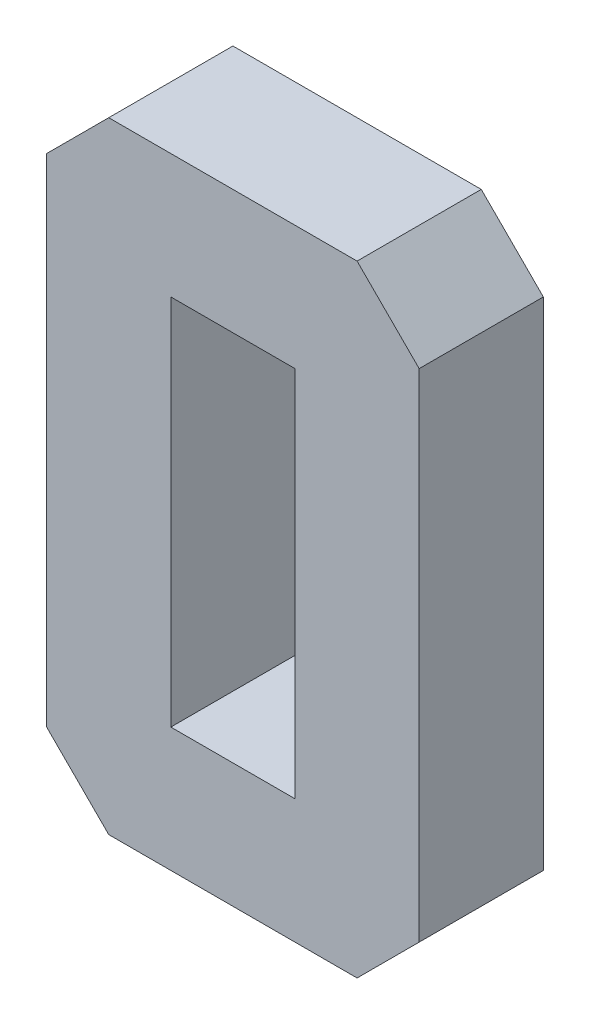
ISO-10303-21;
HEADER;
FILE_DESCRIPTION(('STEP AP214'),'2;1');
FILE_NAME('part.step','',(''),(''),'','','');
FILE_SCHEMA(('AUTOMOTIVE_DESIGN { 1 0 10303 214 1 1 1 1 }'));
ENDSEC;
DATA;
#1=APPLICATION_CONTEXT('core data for automotive mechanical design processes');
#2=APPLICATION_PROTOCOL_DEFINITION('international standard','automotive_design',2000,#1);
#3=PRODUCT_CONTEXT('',#1,'mechanical');
#4=PRODUCT('Part','Part','',(#3));
#5=PRODUCT_RELATED_PRODUCT_CATEGORY('part','',(#4));
#6=PRODUCT_DEFINITION_FORMATION('','',#4);
#7=PRODUCT_DEFINITION_CONTEXT('part definition',#1,'design');
#8=PRODUCT_DEFINITION('design','',#6,#7);
#9=PRODUCT_DEFINITION_SHAPE('','',#8);
#10=(LENGTH_UNIT() NAMED_UNIT(*) SI_UNIT(.MILLI.,.METRE.));
#11=(NAMED_UNIT(*) PLANE_ANGLE_UNIT() SI_UNIT($,.RADIAN.));
#12=(NAMED_UNIT(*) SI_UNIT($,.STERADIAN.) SOLID_ANGLE_UNIT());
#13=UNCERTAINTY_MEASURE_WITH_UNIT(LENGTH_MEASURE(1.E-05),#10,'distance_accuracy_value','');
#14=(GEOMETRIC_REPRESENTATION_CONTEXT(3) GLOBAL_UNCERTAINTY_ASSIGNED_CONTEXT((#13)) GLOBAL_UNIT_ASSIGNED_CONTEXT((#10,
#11,#12)) REPRESENTATION_CONTEXT('',''));
#15=CARTESIAN_POINT('',(0.,0.,0.));
#16=DIRECTION('',(0.,0.,1.));
#17=DIRECTION('',(1.,0.,0.));
#18=AXIS2_PLACEMENT_3D('',#15,#16,#17);
#19=CARTESIAN_POINT('',(0.,0.,10.));
#20=DIRECTION('',(0.,0.,-1.));
#21=DIRECTION('',(-1.,0.,0.));
#22=AXIS2_PLACEMENT_3D('',#19,#20,#21);
#23=PLANE('',#22);
#24=DIRECTION('',(0.,-1.,0.));
#25=VECTOR('',#24,1.);
#26=CARTESIAN_POINT('',(0.,0.,10.));
#27=LINE('',#26,#25);
#28=CARTESIAN_POINT('',(0.,45.,10.));
#29=VERTEX_POINT('',#28);
#30=CARTESIAN_POINT('',(0.,5.00000000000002,10.));
#31=VERTEX_POINT('',#30);
#32=EDGE_CURVE('E164',#29,#31,#27,.T.);
#33=ORIENTED_EDGE('',*,*,#32,.T.);
#34=DIRECTION('',(-0.707106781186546,0.707106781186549,0.));
#35=VECTOR('',#34,1.);
#36=CARTESIAN_POINT('',(5.,0.,10.));
#37=LINE('',#36,#35);
#38=CARTESIAN_POINT('',(5.,0.,10.));
#39=VERTEX_POINT('',#38);
#40=EDGE_CURVE('E207',#31,#39,#37,.F.);
#41=ORIENTED_EDGE('',*,*,#40,.T.);
#42=DIRECTION('',(1.,0.,0.));
#43=VECTOR('',#42,1.);
#44=CARTESIAN_POINT('',(0.,0.,10.));
#45=LINE('',#44,#43);
#46=CARTESIAN_POINT('',(25.,0.,10.));
#47=VERTEX_POINT('',#46);
#48=EDGE_CURVE('E167',#39,#47,#45,.T.);
#49=ORIENTED_EDGE('',*,*,#48,.T.);
#50=DIRECTION('',(-0.707106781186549,-0.707106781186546,0.));
#51=VECTOR('',#50,1.);
#52=CARTESIAN_POINT('',(30.,5.,10.));
#53=LINE('',#52,#51);
#54=CARTESIAN_POINT('',(30.,5.,10.));
#55=VERTEX_POINT('',#54);
#56=EDGE_CURVE('E205',#47,#55,#53,.F.);
#57=ORIENTED_EDGE('',*,*,#56,.T.);
#58=DIRECTION('',(0.,1.,0.));
#59=VECTOR('',#58,1.);
#60=CARTESIAN_POINT('',(30.,0.,10.));
#61=LINE('',#60,#59);
#62=CARTESIAN_POINT('',(30.,45.,10.));
#63=VERTEX_POINT('',#62);
#64=EDGE_CURVE('E171',#55,#63,#61,.T.);
#65=ORIENTED_EDGE('',*,*,#64,.T.);
#66=DIRECTION('',(0.707106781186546,-0.707106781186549,0.));
#67=VECTOR('',#66,1.);
#68=CARTESIAN_POINT('',(25.,50.,10.));
#69=LINE('',#68,#67);
#70=CARTESIAN_POINT('',(25.,50.,10.));
#71=VERTEX_POINT('',#70);
#72=EDGE_CURVE('E53',#63,#71,#69,.F.);
#73=ORIENTED_EDGE('',*,*,#72,.T.);
#74=DIRECTION('',(-1.,0.,0.));
#75=VECTOR('',#74,1.);
#76=CARTESIAN_POINT('',(0.,50.,10.));
#77=LINE('',#76,#75);
#78=CARTESIAN_POINT('',(5.00000000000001,50.,10.));
#79=VERTEX_POINT('',#78);
#80=EDGE_CURVE('E173',#71,#79,#77,.T.);
#81=ORIENTED_EDGE('',*,*,#80,.T.);
#82=DIRECTION('',(0.707106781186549,0.707106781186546,0.));
#83=VECTOR('',#82,1.);
#84=CARTESIAN_POINT('',(0.,45.,10.));
#85=LINE('',#84,#83);
#86=EDGE_CURVE('E203',#79,#29,#85,.F.);
#87=ORIENTED_EDGE('',*,*,#86,.T.);
#88=EDGE_LOOP('',(#33,#41,#49,#57,#65,#73,#81,#87));
#89=FACE_BOUND('',#88,.T.);
#90=DIRECTION('',(0.,-1.,0.));
#91=VECTOR('',#90,1.);
#92=CARTESIAN_POINT('',(10.,40.,10.));
#93=LINE('',#92,#91);
#94=CARTESIAN_POINT('',(10.,40.,10.));
#95=VERTEX_POINT('',#94);
#96=CARTESIAN_POINT('',(10.,10.,10.));
#97=VERTEX_POINT('',#96);
#98=EDGE_CURVE('E123',#95,#97,#93,.T.);
#99=ORIENTED_EDGE('',*,*,#98,.F.);
#100=DIRECTION('',(-1.,0.,0.));
#101=VECTOR('',#100,1.);
#102=CARTESIAN_POINT('',(10.,40.,10.));
#103=LINE('',#102,#101);
#104=CARTESIAN_POINT('',(20.,40.,10.));
#105=VERTEX_POINT('',#104);
#106=EDGE_CURVE('E148',#105,#95,#103,.T.);
#107=ORIENTED_EDGE('',*,*,#106,.F.);
#108=DIRECTION('',(0.,1.,0.));
#109=VECTOR('',#108,1.);
#110=CARTESIAN_POINT('',(20.,40.,10.));
#111=LINE('',#110,#109);
#112=CARTESIAN_POINT('',(20.,10.,10.));
#113=VERTEX_POINT('',#112);
#114=EDGE_CURVE('E146',#113,#105,#111,.T.);
#115=ORIENTED_EDGE('',*,*,#114,.F.);
#116=DIRECTION('',(1.,0.,0.));
#117=VECTOR('',#116,1.);
#118=CARTESIAN_POINT('',(10.,10.,10.));
#119=LINE('',#118,#117);
#120=EDGE_CURVE('E133',#97,#113,#119,.T.);
#121=ORIENTED_EDGE('',*,*,#120,.F.);
#122=EDGE_LOOP('',(#99,#107,#115,#121));
#123=FACE_BOUND('',#122,.T.);
#124=ADVANCED_FACE('F33',(#89,#123),#23,.F.);
#125=CARTESIAN_POINT('',(0.,0.,0.));
#126=DIRECTION('',(0.,0.,-1.));
#127=DIRECTION('',(-1.,0.,0.));
#128=AXIS2_PLACEMENT_3D('',#125,#126,#127);
#129=PLANE('',#128);
#130=DIRECTION('',(1.,0.,0.));
#131=VECTOR('',#130,1.);
#132=CARTESIAN_POINT('',(0.,0.,0.));
#133=LINE('',#132,#131);
#134=CARTESIAN_POINT('',(5.,0.,0.));
#135=VERTEX_POINT('',#134);
#136=CARTESIAN_POINT('',(25.,0.,0.));
#137=VERTEX_POINT('',#136);
#138=EDGE_CURVE('E178',#135,#137,#133,.T.);
#139=ORIENTED_EDGE('',*,*,#138,.F.);
#140=DIRECTION('',(0.707106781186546,-0.707106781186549,0.));
#141=VECTOR('',#140,1.);
#142=CARTESIAN_POINT('',(2.50000000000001,2.5,0.));
#143=LINE('',#142,#141);
#144=CARTESIAN_POINT('',(0.,5.00000000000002,0.));
#145=VERTEX_POINT('',#144);
#146=EDGE_CURVE('E195',#135,#145,#143,.F.);
#147=ORIENTED_EDGE('',*,*,#146,.T.);
#148=DIRECTION('',(0.,-1.,0.));
#149=VECTOR('',#148,1.);
#150=CARTESIAN_POINT('',(0.,0.,0.));
#151=LINE('',#150,#149);
#152=CARTESIAN_POINT('',(0.,45.,0.));
#153=VERTEX_POINT('',#152);
#154=EDGE_CURVE('E141',#153,#145,#151,.T.);
#155=ORIENTED_EDGE('',*,*,#154,.F.);
#156=DIRECTION('',(-0.707106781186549,-0.707106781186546,0.));
#157=VECTOR('',#156,1.);
#158=CARTESIAN_POINT('',(-22.5,22.5000000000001,0.));
#159=LINE('',#158,#157);
#160=CARTESIAN_POINT('',(5.00000000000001,50.,0.));
#161=VERTEX_POINT('',#160);
#162=EDGE_CURVE('E191',#153,#161,#159,.F.);
#163=ORIENTED_EDGE('',*,*,#162,.T.);
#164=DIRECTION('',(-1.,0.,0.));
#165=VECTOR('',#164,1.);
#166=CARTESIAN_POINT('',(0.,50.,0.));
#167=LINE('',#166,#165);
#168=CARTESIAN_POINT('',(25.,50.,0.));
#169=VERTEX_POINT('',#168);
#170=EDGE_CURVE('E168',#169,#161,#167,.T.);
#171=ORIENTED_EDGE('',*,*,#170,.F.);
#172=DIRECTION('',(-0.707106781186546,0.707106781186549,0.));
#173=VECTOR('',#172,1.);
#174=CARTESIAN_POINT('',(37.5,37.4999999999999,0.));
#175=LINE('',#174,#173);
#176=CARTESIAN_POINT('',(30.,45.,0.));
#177=VERTEX_POINT('',#176);
#178=EDGE_CURVE('E189',#169,#177,#175,.F.);
#179=ORIENTED_EDGE('',*,*,#178,.T.);
#180=DIRECTION('',(0.,1.,0.));
#181=VECTOR('',#180,1.);
#182=CARTESIAN_POINT('',(30.,0.,0.));
#183=LINE('',#182,#181);
#184=CARTESIAN_POINT('',(30.,5.,0.));
#185=VERTEX_POINT('',#184);
#186=EDGE_CURVE('E181',#185,#177,#183,.T.);
#187=ORIENTED_EDGE('',*,*,#186,.F.);
#188=DIRECTION('',(0.707106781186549,0.707106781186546,0.));
#189=VECTOR('',#188,1.);
#190=CARTESIAN_POINT('',(12.4999999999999,-12.5,0.));
#191=LINE('',#190,#189);
#192=EDGE_CURVE('E193',#185,#137,#191,.F.);
#193=ORIENTED_EDGE('',*,*,#192,.T.);
#194=EDGE_LOOP('',(#139,#147,#155,#163,#171,#179,#187,#193));
#195=FACE_BOUND('',#194,.T.);
#196=DIRECTION('',(-1.,0.,0.));
#197=VECTOR('',#196,1.);
#198=CARTESIAN_POINT('',(10.,40.,0.));
#199=LINE('',#198,#197);
#200=CARTESIAN_POINT('',(20.,40.,0.));
#201=VERTEX_POINT('',#200);
#202=CARTESIAN_POINT('',(10.,40.,0.));
#203=VERTEX_POINT('',#202);
#204=EDGE_CURVE('E134',#201,#203,#199,.T.);
#205=ORIENTED_EDGE('',*,*,#204,.T.);
#206=DIRECTION('',(0.,-1.,0.));
#207=VECTOR('',#206,1.);
#208=CARTESIAN_POINT('',(10.,40.,0.));
#209=LINE('',#208,#207);
#210=CARTESIAN_POINT('',(10.,10.,0.));
#211=VERTEX_POINT('',#210);
#212=EDGE_CURVE('E152',#203,#211,#209,.T.);
#213=ORIENTED_EDGE('',*,*,#212,.T.);
#214=DIRECTION('',(1.,0.,0.));
#215=VECTOR('',#214,1.);
#216=CARTESIAN_POINT('',(10.,10.,0.));
#217=LINE('',#216,#215);
#218=CARTESIAN_POINT('',(20.,10.,0.));
#219=VERTEX_POINT('',#218);
#220=EDGE_CURVE('E140',#211,#219,#217,.T.);
#221=ORIENTED_EDGE('',*,*,#220,.T.);
#222=DIRECTION('',(0.,1.,0.));
#223=VECTOR('',#222,1.);
#224=CARTESIAN_POINT('',(20.,40.,0.));
#225=LINE('',#224,#223);
#226=EDGE_CURVE('E155',#219,#201,#225,.T.);
#227=ORIENTED_EDGE('',*,*,#226,.T.);
#228=EDGE_LOOP('',(#205,#213,#221,#227));
#229=FACE_BOUND('',#228,.T.);
#230=ADVANCED_FACE('F220',(#195,#229),#129,.T.);
#231=CARTESIAN_POINT('',(0.,0.,10.));
#232=DIRECTION('',(1.,0.,0.));
#233=DIRECTION('',(0.,0.,-1.));
#234=AXIS2_PLACEMENT_3D('',#231,#232,#233);
#235=PLANE('',#234);
#236=ORIENTED_EDGE('',*,*,#154,.T.);
#237=DIRECTION('',(0.,0.,1.));
#238=VECTOR('',#237,1.);
#239=CARTESIAN_POINT('',(0.,5.00000000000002,10.));
#240=LINE('',#239,#238);
#241=EDGE_CURVE('E200',#145,#31,#240,.T.);
#242=ORIENTED_EDGE('',*,*,#241,.T.);
#243=ORIENTED_EDGE('',*,*,#32,.F.);
#244=DIRECTION('',(0.,0.,-1.));
#245=VECTOR('',#244,1.);
#246=CARTESIAN_POINT('',(0.,45.,10.));
#247=LINE('',#246,#245);
#248=EDGE_CURVE('E197',#29,#153,#247,.T.);
#249=ORIENTED_EDGE('',*,*,#248,.T.);
#250=EDGE_LOOP('',(#236,#242,#243,#249));
#251=FACE_BOUND('',#250,.T.);
#252=ADVANCED_FACE('F230',(#251),#235,.F.);
#253=CARTESIAN_POINT('',(0.,0.,10.));
#254=DIRECTION('',(0.,1.,0.));
#255=DIRECTION('',(0.,0.,1.));
#256=AXIS2_PLACEMENT_3D('',#253,#254,#255);
#257=PLANE('',#256);
#258=ORIENTED_EDGE('',*,*,#48,.F.);
#259=DIRECTION('',(0.,0.,-1.));
#260=VECTOR('',#259,1.);
#261=CARTESIAN_POINT('',(5.,0.,10.));
#262=LINE('',#261,#260);
#263=EDGE_CURVE('E186',#39,#135,#262,.T.);
#264=ORIENTED_EDGE('',*,*,#263,.T.);
#265=ORIENTED_EDGE('',*,*,#138,.T.);
#266=DIRECTION('',(0.,0.,1.));
#267=VECTOR('',#266,1.);
#268=CARTESIAN_POINT('',(25.,0.,10.));
#269=LINE('',#268,#267);
#270=EDGE_CURVE('E175',#137,#47,#269,.T.);
#271=ORIENTED_EDGE('',*,*,#270,.T.);
#272=EDGE_LOOP('',(#258,#264,#265,#271));
#273=FACE_BOUND('',#272,.T.);
#274=ADVANCED_FACE('F238',(#273),#257,.F.);
#275=CARTESIAN_POINT('',(30.,0.,10.));
#276=DIRECTION('',(-1.,0.,0.));
#277=DIRECTION('',(0.,0.,1.));
#278=AXIS2_PLACEMENT_3D('',#275,#276,#277);
#279=PLANE('',#278);
#280=ORIENTED_EDGE('',*,*,#64,.F.);
#281=DIRECTION('',(0.,0.,-1.));
#282=VECTOR('',#281,1.);
#283=CARTESIAN_POINT('',(30.,5.,10.));
#284=LINE('',#283,#282);
#285=EDGE_CURVE('E211',#55,#185,#284,.T.);
#286=ORIENTED_EDGE('',*,*,#285,.T.);
#287=ORIENTED_EDGE('',*,*,#186,.T.);
#288=DIRECTION('',(0.,0.,1.));
#289=VECTOR('',#288,1.);
#290=CARTESIAN_POINT('',(30.,45.,10.));
#291=LINE('',#290,#289);
#292=EDGE_CURVE('E209',#177,#63,#291,.T.);
#293=ORIENTED_EDGE('',*,*,#292,.T.);
#294=EDGE_LOOP('',(#280,#286,#287,#293));
#295=FACE_BOUND('',#294,.T.);
#296=ADVANCED_FACE('F246',(#295),#279,.F.);
#297=CARTESIAN_POINT('',(0.,50.,10.));
#298=DIRECTION('',(0.,-1.,0.));
#299=DIRECTION('',(0.,0.,-1.));
#300=AXIS2_PLACEMENT_3D('',#297,#298,#299);
#301=PLANE('',#300);
#302=ORIENTED_EDGE('',*,*,#170,.T.);
#303=DIRECTION('',(0.,0.,1.));
#304=VECTOR('',#303,1.);
#305=CARTESIAN_POINT('',(5.00000000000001,50.,10.));
#306=LINE('',#305,#304);
#307=EDGE_CURVE('E11',#161,#79,#306,.T.);
#308=ORIENTED_EDGE('',*,*,#307,.T.);
#309=ORIENTED_EDGE('',*,*,#80,.F.);
#310=DIRECTION('',(0.,0.,-1.));
#311=VECTOR('',#310,1.);
#312=CARTESIAN_POINT('',(25.,50.,10.));
#313=LINE('',#312,#311);
#314=EDGE_CURVE('E41',#71,#169,#313,.T.);
#315=ORIENTED_EDGE('',*,*,#314,.T.);
#316=EDGE_LOOP('',(#302,#308,#309,#315));
#317=FACE_BOUND('',#316,.T.);
#318=ADVANCED_FACE('F216',(#317),#301,.F.);
#319=CARTESIAN_POINT('',(10.,40.,10.));
#320=DIRECTION('',(1.,0.,0.));
#321=DIRECTION('',(0.,1.,0.));
#322=AXIS2_PLACEMENT_3D('',#319,#320,#321);
#323=PLANE('',#322);
#324=ORIENTED_EDGE('',*,*,#212,.F.);
#325=DIRECTION('',(0.,0.,-1.));
#326=VECTOR('',#325,1.);
#327=CARTESIAN_POINT('',(10.,40.,10.));
#328=LINE('',#327,#326);
#329=EDGE_CURVE('E129',#95,#203,#328,.T.);
#330=ORIENTED_EDGE('',*,*,#329,.F.);
#331=ORIENTED_EDGE('',*,*,#98,.T.);
#332=DIRECTION('',(0.,0.,-1.));
#333=VECTOR('',#332,1.);
#334=CARTESIAN_POINT('',(10.,10.,10.));
#335=LINE('',#334,#333);
#336=EDGE_CURVE('E126',#97,#211,#335,.T.);
#337=ORIENTED_EDGE('',*,*,#336,.T.);
#338=EDGE_LOOP('',(#324,#330,#331,#337));
#339=FACE_BOUND('',#338,.T.);
#340=ADVANCED_FACE('F125',(#339),#323,.T.);
#341=CARTESIAN_POINT('',(10.,10.,10.));
#342=DIRECTION('',(0.,1.,0.));
#343=DIRECTION('',(0.,0.,1.));
#344=AXIS2_PLACEMENT_3D('',#341,#342,#343);
#345=PLANE('',#344);
#346=ORIENTED_EDGE('',*,*,#220,.F.);
#347=ORIENTED_EDGE('',*,*,#336,.F.);
#348=ORIENTED_EDGE('',*,*,#120,.T.);
#349=DIRECTION('',(0.,0.,-1.));
#350=VECTOR('',#349,1.);
#351=CARTESIAN_POINT('',(20.,10.,10.));
#352=LINE('',#351,#350);
#353=EDGE_CURVE('E142',#113,#219,#352,.T.);
#354=ORIENTED_EDGE('',*,*,#353,.T.);
#355=EDGE_LOOP('',(#346,#347,#348,#354));
#356=FACE_BOUND('',#355,.T.);
#357=ADVANCED_FACE('F137',(#356),#345,.T.);
#358=CARTESIAN_POINT('',(20.,40.,10.));
#359=DIRECTION('',(-1.,0.,0.));
#360=DIRECTION('',(0.,0.,1.));
#361=AXIS2_PLACEMENT_3D('',#358,#359,#360);
#362=PLANE('',#361);
#363=ORIENTED_EDGE('',*,*,#226,.F.);
#364=ORIENTED_EDGE('',*,*,#353,.F.);
#365=ORIENTED_EDGE('',*,*,#114,.T.);
#366=DIRECTION('',(0.,0.,-1.));
#367=VECTOR('',#366,1.);
#368=CARTESIAN_POINT('',(20.,40.,10.));
#369=LINE('',#368,#367);
#370=EDGE_CURVE('E161',#105,#201,#369,.T.);
#371=ORIENTED_EDGE('',*,*,#370,.T.);
#372=EDGE_LOOP('',(#363,#364,#365,#371));
#373=FACE_BOUND('',#372,.T.);
#374=ADVANCED_FACE('F302',(#373),#362,.T.);
#375=CARTESIAN_POINT('',(10.,40.,10.));
#376=DIRECTION('',(0.,-1.,0.));
#377=DIRECTION('',(0.,0.,-1.));
#378=AXIS2_PLACEMENT_3D('',#375,#376,#377);
#379=PLANE('',#378);
#380=ORIENTED_EDGE('',*,*,#204,.F.);
#381=ORIENTED_EDGE('',*,*,#370,.F.);
#382=ORIENTED_EDGE('',*,*,#106,.T.);
#383=ORIENTED_EDGE('',*,*,#329,.T.);
#384=EDGE_LOOP('',(#380,#381,#382,#383));
#385=FACE_BOUND('',#384,.T.);
#386=ADVANCED_FACE('F271',(#385),#379,.T.);
#387=CARTESIAN_POINT('',(5.,0.,10.));
#388=DIRECTION('',(0.707106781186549,0.707106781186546,0.));
#389=DIRECTION('',(0.,0.,-1.));
#390=AXIS2_PLACEMENT_3D('',#387,#388,#389);
#391=PLANE('',#390);
#392=ORIENTED_EDGE('',*,*,#40,.F.);
#393=ORIENTED_EDGE('',*,*,#241,.F.);
#394=ORIENTED_EDGE('',*,*,#146,.F.);
#395=ORIENTED_EDGE('',*,*,#263,.F.);
#396=EDGE_LOOP('',(#392,#393,#394,#395));
#397=FACE_BOUND('',#396,.T.);
#398=ADVANCED_FACE('F236',(#397),#391,.F.);
#399=CARTESIAN_POINT('',(30.,5.,10.));
#400=DIRECTION('',(-0.707106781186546,0.707106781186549,0.));
#401=DIRECTION('',(0.,0.,-1.));
#402=AXIS2_PLACEMENT_3D('',#399,#400,#401);
#403=PLANE('',#402);
#404=ORIENTED_EDGE('',*,*,#56,.F.);
#405=ORIENTED_EDGE('',*,*,#270,.F.);
#406=ORIENTED_EDGE('',*,*,#192,.F.);
#407=ORIENTED_EDGE('',*,*,#285,.F.);
#408=EDGE_LOOP('',(#404,#405,#406,#407));
#409=FACE_BOUND('',#408,.T.);
#410=ADVANCED_FACE('F243',(#409),#403,.F.);
#411=CARTESIAN_POINT('',(0.,45.,10.));
#412=DIRECTION('',(0.707106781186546,-0.707106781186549,0.));
#413=DIRECTION('',(0.,0.,-1.));
#414=AXIS2_PLACEMENT_3D('',#411,#412,#413);
#415=PLANE('',#414);
#416=ORIENTED_EDGE('',*,*,#86,.F.);
#417=ORIENTED_EDGE('',*,*,#307,.F.);
#418=ORIENTED_EDGE('',*,*,#162,.F.);
#419=ORIENTED_EDGE('',*,*,#248,.F.);
#420=EDGE_LOOP('',(#416,#417,#418,#419));
#421=FACE_BOUND('',#420,.T.);
#422=ADVANCED_FACE('F227',(#421),#415,.F.);
#423=CARTESIAN_POINT('',(25.,50.,10.));
#424=DIRECTION('',(-0.707106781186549,-0.707106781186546,0.));
#425=DIRECTION('',(0.,0.,-1.));
#426=AXIS2_PLACEMENT_3D('',#423,#424,#425);
#427=PLANE('',#426);
#428=ORIENTED_EDGE('',*,*,#72,.F.);
#429=ORIENTED_EDGE('',*,*,#292,.F.);
#430=ORIENTED_EDGE('',*,*,#178,.F.);
#431=ORIENTED_EDGE('',*,*,#314,.F.);
#432=EDGE_LOOP('',(#428,#429,#430,#431));
#433=FACE_BOUND('',#432,.T.);
#434=ADVANCED_FACE('F35',(#433),#427,.F.);
#435=CLOSED_SHELL('',(#124,#230,#252,#274,#296,#318,#340,#357,#374,#386,#398,#410,#422,#434));
#436=MANIFOLD_SOLID_BREP('B2',#435);
#437=ADVANCED_BREP_SHAPE_REPRESENTATION('',(#18,#436),#14);
#438=SHAPE_DEFINITION_REPRESENTATION(#9,#437);
ENDSEC;
END-ISO-10303-21;
